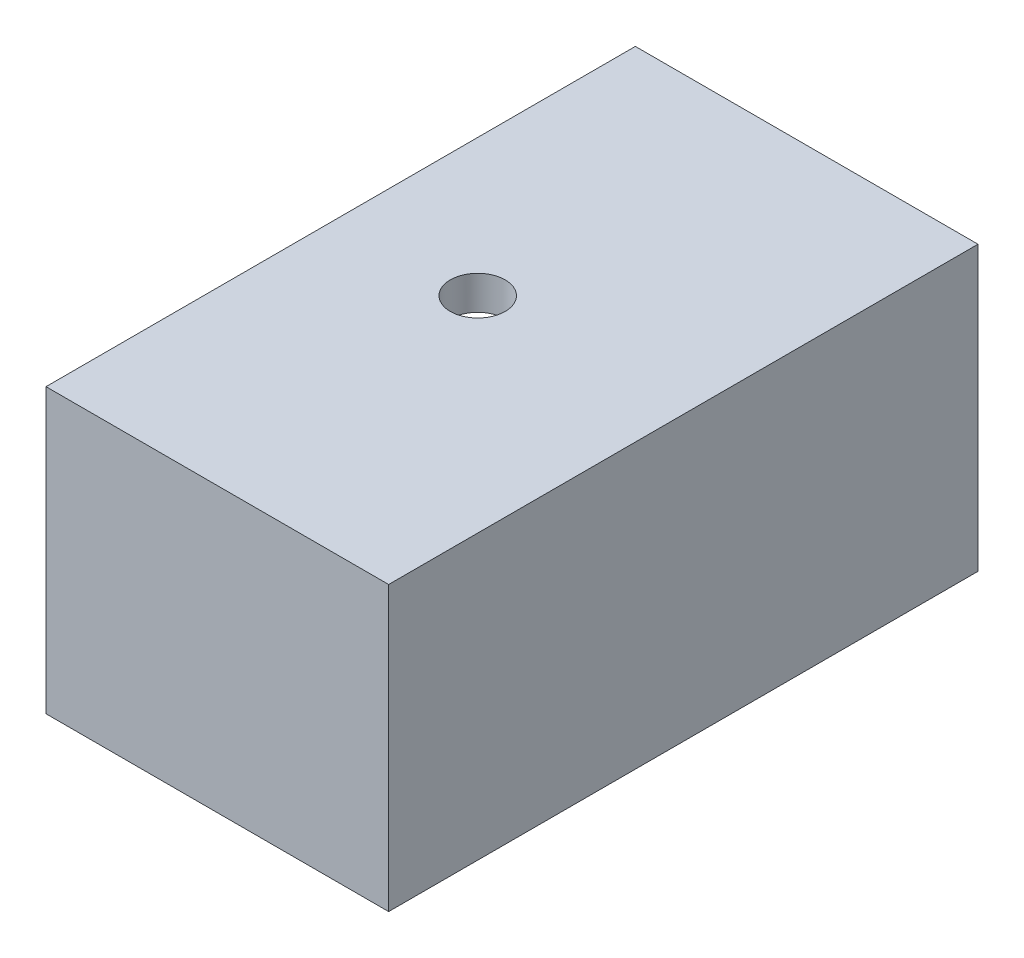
from build123d import *

# Parameters (mm, degrees)
SKETCH1_W           = 25
SKETCH1_H           = 43
BOSS_EXTRUDE1_DEPTH = 20.67
SKETCH2_W           = 23
SKETCH2_H           = 15.735859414
CUT_EXTRUDE1_DEPTH  = 18
SKETCH3_R           = 2
CUT_EXTRUDE2_DEPTH  = 33.338041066


with BuildPart() as part:
    # Sketch1 → Boss-Extrude1 (new body)
    with BuildSketch(Plane(origin=(0, 0, 0), x_dir=(1, 0, 0), z_dir=(0, 1, 0))):
        Rectangle(SKETCH1_W, SKETCH1_H)
    extrude(amount=BOSS_EXTRUDE1_DEPTH)

    # Sketch2 → Cut-Extrude1 (cut)
    with BuildSketch(Plane.ZY.offset(12.5)):
        with Locations((0, 10.335)):
            Rectangle(SKETCH2_W, SKETCH2_H)
    extrude(amount=-CUT_EXTRUDE1_DEPTH, mode=Mode.SUBTRACT)

    # Sketch3 → Cut-Extrude2 (cut, through all)
    with BuildSketch(Plane.XZ):
        with Locations(Location((-2.5, 0, 0), (0, 0, 270))):
            Circle(SKETCH3_R)
    extrude(amount=-CUT_EXTRUDE2_DEPTH, mode=Mode.SUBTRACT)


solid = part.part
